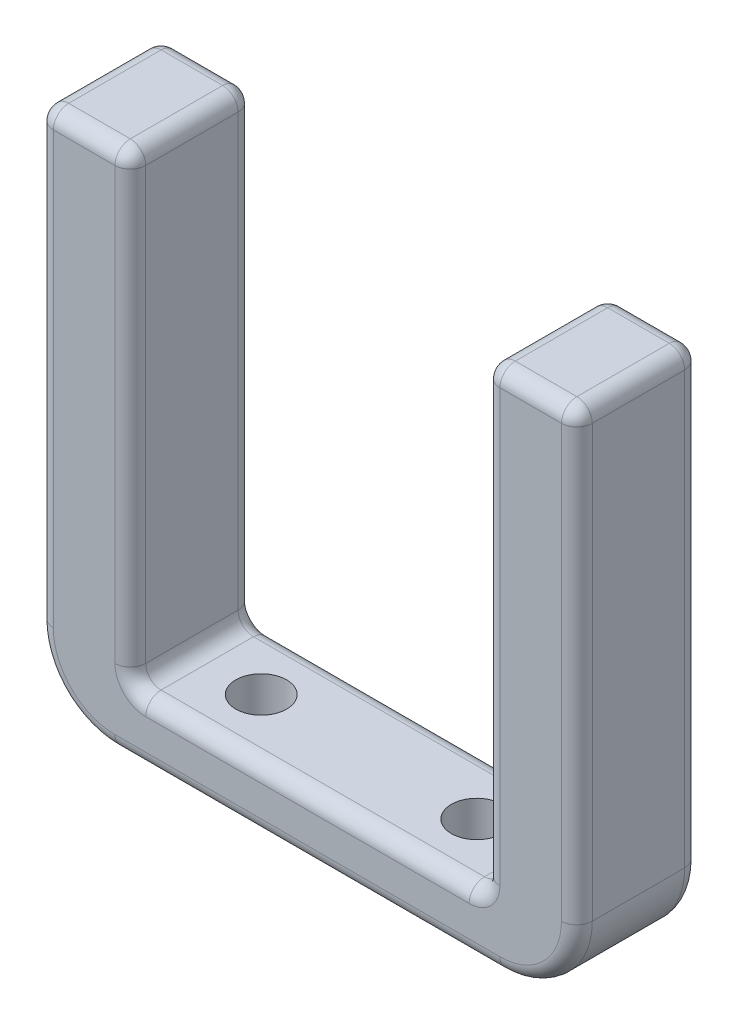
from build123d import *

# Parameters (mm, degrees)
BOSS_EXTRUDE1_DEPTH = 8
CUT_EXTRUDE1_DEPTH  = 10
FILLET1_R           = 1
SKETCH3_R           = 1.65
CUT_EXTRUDE2_DEPTH  = 50.44694126


with BuildPart() as part:
    # Sketch1 → Boss-Extrude1 (new body)
    with BuildSketch(Plane.XY):
        with BuildLine():
            Line((0, 0), (0, -29))
            ThreePointArc((0, -29), (1.464466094, -32.535533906), (5, -34))
            Line((5, -34), (30, -34))
            ThreePointArc((30, -34), (33.535533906, -32.535533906), (35, -29))
            Line((35, -29), (35, 0))
            Line((35, 0), (0, 0))
        make_face()
    extrude(amount=BOSS_EXTRUDE1_DEPTH)

    # Sketch2 → Cut-Extrude1 (cut)
    with BuildSketch(Plane.XY.offset(8)):
        with BuildLine():
            Line((6, 0), (29, 0))
            Line((29, 0), (29, -29))
            ThreePointArc((29, -29), (28.707106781, -29.707106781), (28, -30))
            Line((28, -30), (7, -30))
            ThreePointArc((7, -30), (6.292893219, -29.707106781), (6, -29))
            Line((6, -29), (6, 0))
        make_face()
    extrude(amount=-CUT_EXTRUDE1_DEPTH, mode=Mode.SUBTRACT)

    # Fillet1
    fillet1_edges = [part.edges().sort_by_distance(p)[0] for p in [
        (1.464466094, -32.535533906, 0),
        (0, -14.5, 0),
        (1.464466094, -32.535533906, 8),
        (0, 0, 4),
        (35, 0, 4),
        (17.5, -34, 8),
        (33.535533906, -32.535533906, 8),
        (32, 0, 0),
        (29, -14.5, 0),
        (28.707106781, -29.707106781, 0),
        (17.5, -30, 0),
        (6.292893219, -29.707106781, 0),
        (6, -14.5, 0),
        (32, 0, 8),
        (35, -14.5, 8),
        (6, 0, 4),
        (29, 0, 4),
        (3, 0, 8),
        (28.707106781, -29.707106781, 8),
        (29, -14.5, 8),
        (6, -14.5, 8),
        (6.292893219, -29.707106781, 8),
        (17.5, -30, 8),
        (0, -14.5, 8),
        (3, 0, 0),
        (35, -14.5, 0),
        (33.535533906, -32.535533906, 0),
        (17.5, -34, 0),
    ]]
    fillet(fillet1_edges, radius=FILLET1_R)

    # Sketch3 → Cut-Extrude2 (cut, through all)
    with BuildSketch(Plane.XZ.offset(34)):
        with Locations(Location((24.5, 4, 0), (0, 0, 270))):
            Circle(SKETCH3_R)
        with Locations(Location((10.5, 4, 0), (0, 0, 270))):
            Circle(SKETCH3_R)
    extrude(amount=-CUT_EXTRUDE2_DEPTH, mode=Mode.SUBTRACT)


solid = part.part
